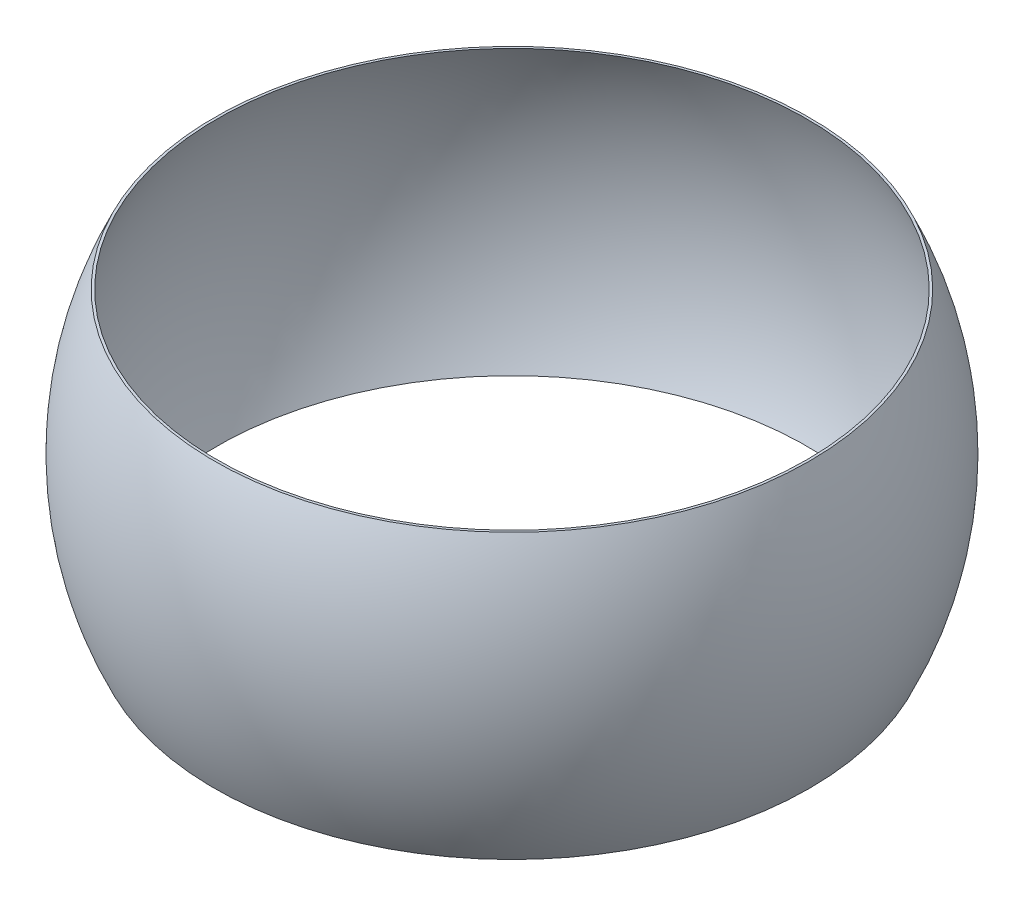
ISO-10303-21;
HEADER;
FILE_DESCRIPTION(('STEP AP214'),'2;1');
FILE_NAME('part.step','',(''),(''),'','','');
FILE_SCHEMA(('AUTOMOTIVE_DESIGN { 1 0 10303 214 1 1 1 1 }'));
ENDSEC;
DATA;
#1=APPLICATION_CONTEXT('core data for automotive mechanical design processes');
#2=APPLICATION_PROTOCOL_DEFINITION('international standard','automotive_design',2000,#1);
#3=PRODUCT_CONTEXT('',#1,'mechanical');
#4=PRODUCT('Part','Part','',(#3));
#5=PRODUCT_RELATED_PRODUCT_CATEGORY('part','',(#4));
#6=PRODUCT_DEFINITION_FORMATION('','',#4);
#7=PRODUCT_DEFINITION_CONTEXT('part definition',#1,'design');
#8=PRODUCT_DEFINITION('design','',#6,#7);
#9=PRODUCT_DEFINITION_SHAPE('','',#8);
#10=(LENGTH_UNIT() NAMED_UNIT(*) SI_UNIT(.MILLI.,.METRE.));
#11=(NAMED_UNIT(*) PLANE_ANGLE_UNIT() SI_UNIT($,.RADIAN.));
#12=(NAMED_UNIT(*) SI_UNIT($,.STERADIAN.) SOLID_ANGLE_UNIT());
#13=UNCERTAINTY_MEASURE_WITH_UNIT(LENGTH_MEASURE(1.E-05),#10,'distance_accuracy_value','');
#14=(GEOMETRIC_REPRESENTATION_CONTEXT(3) GLOBAL_UNCERTAINTY_ASSIGNED_CONTEXT((#13)) GLOBAL_UNIT_ASSIGNED_CONTEXT((#10,
#11,#12)) REPRESENTATION_CONTEXT('',''));
#15=CARTESIAN_POINT('',(0.,0.,0.));
#16=DIRECTION('',(0.,0.,1.));
#17=DIRECTION('',(1.,0.,0.));
#18=AXIS2_PLACEMENT_3D('',#15,#16,#17);
#19=CARTESIAN_POINT('',(0.,0.,0.));
#20=DIRECTION('',(0.,1.,0.));
#21=DIRECTION('',(1.,0.,0.));
#22=AXIS2_PLACEMENT_3D('',#19,#20,#21);
#23=SPHERICAL_SURFACE('',#22,7.4803);
#24=CARTESIAN_POINT('',(0.,-3.23850000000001,0.));
#25=DIRECTION('',(0.,1.,0.));
#26=DIRECTION('',(0.,0.,1.));
#27=AXIS2_PLACEMENT_3D('',#24,#25,#26);
#28=CIRCLE('',#27,6.74292264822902);
#29=CARTESIAN_POINT('',(6.74292264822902,-3.23850000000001,0.));
#30=VERTEX_POINT('',#29);
#31=EDGE_CURVE('E10',#30,#30,#28,.T.);
#32=CARTESIAN_POINT('',(0.,3.23849999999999,0.));
#33=DIRECTION('',(0.,1.,0.));
#34=DIRECTION('',(0.,0.,1.));
#35=AXIS2_PLACEMENT_3D('',#32,#33,#34);
#36=CIRCLE('',#35,6.74292264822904);
#37=CARTESIAN_POINT('',(6.74292264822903,3.23849999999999,0.));
#38=VERTEX_POINT('',#37);
#39=EDGE_CURVE('E48',#38,#38,#36,.T.);
#40=CARTESIAN_POINT('',(6.74292264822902,-3.23850000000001,0.));
#41=CARTESIAN_POINT('',(6.77313193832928,-3.17560148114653,0.));
#42=CARTESIAN_POINT('',(6.80246064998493,-3.11228005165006,0.));
#43=CARTESIAN_POINT('',(6.85933505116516,-2.98484144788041,0.));
#44=CARTESIAN_POINT('',(6.88688074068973,-2.92072427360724,0.));
#45=CARTESIAN_POINT('',(6.94016723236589,-2.79174425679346,0.));
#46=CARTESIAN_POINT('',(6.96590803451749,-2.72688141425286,0.));
#47=CARTESIAN_POINT('',(7.01556467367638,-2.59646088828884,0.));
#48=CARTESIAN_POINT('',(7.03948051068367,-2.53090320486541,0.));
#49=CARTESIAN_POINT('',(7.08546847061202,-2.39914432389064,0.));
#50=CARTESIAN_POINT('',(7.10754059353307,-2.33294312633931,0.));
#51=CARTESIAN_POINT('',(7.14982384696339,-2.19994905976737,0.));
#52=CARTESIAN_POINT('',(7.17003497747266,-2.13315619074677,0.));
#53=CARTESIAN_POINT('',(7.20858041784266,-1.99903108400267,0.));
#54=CARTESIAN_POINT('',(7.22691472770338,-1.93169884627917,0.));
#55=CARTESIAN_POINT('',(7.26169217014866,-1.79654772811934,0.));
#56=CARTESIAN_POINT('',(7.2781353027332,-1.72872884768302,0.));
#57=CARTESIAN_POINT('',(7.30911751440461,-1.59265755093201,0.));
#58=CARTESIAN_POINT('',(7.32365659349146,-1.52440513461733,0.));
#59=CARTESIAN_POINT('',(7.35081931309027,-1.38752021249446,0.));
#60=CARTESIAN_POINT('',(7.36344295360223,-1.31888770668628,0.));
#61=CARTESIAN_POINT('',(7.38676491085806,-1.18129634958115,0.));
#62=CARTESIAN_POINT('',(7.39746322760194,-1.11233749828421,0.));
#63=CARTESIAN_POINT('',(7.41692615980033,-0.974147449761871,0.));
#64=CARTESIAN_POINT('',(7.42569077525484,-0.904916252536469,0.));
#65=CARTESIAN_POINT('',(7.44127944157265,-0.766235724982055,0.));
#66=CARTESIAN_POINT('',(7.44810349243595,-0.696786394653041,0.));
#67=CARTESIAN_POINT('',(7.45980568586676,-0.557723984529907,0.));
#68=CARTESIAN_POINT('',(7.46468382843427,-0.488110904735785,0.));
#69=CARTESIAN_POINT('',(7.47249038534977,-0.348775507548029,0.));
#70=CARTESIAN_POINT('',(7.47541879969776,-0.279053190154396,0.));
#71=CARTESIAN_POINT('',(7.47932360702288,-0.139553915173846,0.));
#72=CARTESIAN_POINT('',(7.4803,-0.0697769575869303,0.));
#73=CARTESIAN_POINT('',(7.4803,0.0697769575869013,0.));
#74=CARTESIAN_POINT('',(7.47932360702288,0.139553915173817,0.));
#75=CARTESIAN_POINT('',(7.47541879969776,0.279053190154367,0.));
#76=CARTESIAN_POINT('',(7.47249038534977,0.348775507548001,0.));
#77=CARTESIAN_POINT('',(7.46468382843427,0.488110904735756,0.));
#78=CARTESIAN_POINT('',(7.45980568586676,0.557723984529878,0.));
#79=CARTESIAN_POINT('',(7.44810349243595,0.696786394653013,0.));
#80=CARTESIAN_POINT('',(7.44127944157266,0.766235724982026,0.));
#81=CARTESIAN_POINT('',(7.42569077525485,0.90491625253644,0.));
#82=CARTESIAN_POINT('',(7.41692615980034,0.974147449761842,0.));
#83=CARTESIAN_POINT('',(7.39746322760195,1.11233749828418,0.));
#84=CARTESIAN_POINT('',(7.38676491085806,1.18129634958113,0.));
#85=CARTESIAN_POINT('',(7.36344295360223,1.31888770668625,0.));
#86=CARTESIAN_POINT('',(7.35081931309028,1.38752021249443,0.));
#87=CARTESIAN_POINT('',(7.32365659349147,1.5244051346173,0.));
#88=CARTESIAN_POINT('',(7.30911751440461,1.59265755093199,0.));
#89=CARTESIAN_POINT('',(7.27813530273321,1.72872884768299,0.));
#90=CARTESIAN_POINT('',(7.26169217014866,1.79654772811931,0.));
#91=CARTESIAN_POINT('',(7.22691472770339,1.93169884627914,0.));
#92=CARTESIAN_POINT('',(7.20858041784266,1.99903108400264,0.));
#93=CARTESIAN_POINT('',(7.17003497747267,2.13315619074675,0.));
#94=CARTESIAN_POINT('',(7.1498238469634,2.19994905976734,0.));
#95=CARTESIAN_POINT('',(7.10754059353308,2.33294312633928,0.));
#96=CARTESIAN_POINT('',(7.08546847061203,2.39914432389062,0.));
#97=CARTESIAN_POINT('',(7.03948051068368,2.53090320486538,0.));
#98=CARTESIAN_POINT('',(7.01556467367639,2.59646088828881,0.));
#99=CARTESIAN_POINT('',(6.9659080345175,2.72688141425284,0.));
#100=CARTESIAN_POINT('',(6.9401672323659,2.79174425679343,0.));
#101=CARTESIAN_POINT('',(6.88688074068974,2.92072427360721,0.));
#102=CARTESIAN_POINT('',(6.85933505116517,2.98484144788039,0.));
#103=CARTESIAN_POINT('',(6.80246064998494,3.11228005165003,0.));
#104=CARTESIAN_POINT('',(6.77313193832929,3.17560148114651,0.));
#105=CARTESIAN_POINT('',(6.74292264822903,3.23849999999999,0.));
#106=B_SPLINE_CURVE_WITH_KNOTS('',3,(#40,#41,#42,#43,#44,#45,#46,#47,#48,#49,#50,#51,#52,#53,
#54,#55,#56,#57,#58,#59,#60,#61,#62,#63,#64,#65,#66,#67,#68,#69,#70,#71,#72,#73,#74,#75,#76,#77,
#78,#79,#80,#81,#82,#83,#84,#85,#86,#87,#88,#89,#90,#91,#92,#93,#94,#95,#96,#97,#98,#99,#100,
#101,#102,#103,#104,#105),.UNSPECIFIED.,.F.,.F.,(4,2,2,2,2,2,2,2,2,2,2,2,2,2,2,2,2,2,2,2,2,2,2,
2,2,2,2,2,2,2,2,2,4),(0.,0.20932404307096,0.41864808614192,0.627972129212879,0.837296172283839,
1.0466202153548,1.25594425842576,1.46526830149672,1.67459234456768,1.88391638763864,
2.0932404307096,2.30256447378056,2.51188851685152,2.72121255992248,2.93053660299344,
3.1398606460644,3.34918468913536,3.55850873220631,3.76783277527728,3.97715681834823,
4.1864808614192,4.39580490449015,4.60512894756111,4.81445299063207,5.02377703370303,
5.23310107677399,5.44242511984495,5.65174916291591,5.86107320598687,6.07039724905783,
6.27972129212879,6.48904533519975,6.69836937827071),.UNSPECIFIED.);
#107=EDGE_CURVE('BSEAM34',#30,#38,#106,.T.);
#108=ORIENTED_EDGE('',*,*,#31,.F.);
#109=ORIENTED_EDGE('',*,*,#39,.T.);
#110=ORIENTED_EDGE('',*,*,#107,.T.);
#111=ORIENTED_EDGE('',*,*,#107,.F.);
#112=EDGE_LOOP('',(#108,#110,#109,#111));
#113=FACE_BOUND('',#112,.T.);
#114=ADVANCED_FACE('F34',(#113),#23,.F.);
#115=CARTESIAN_POINT('',(6.74292264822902,-3.23850000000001,0.));
#116=DIRECTION('',(0.,1.,0.));
#117=DIRECTION('',(0.,0.,1.));
#118=AXIS2_PLACEMENT_3D('',#115,#116,#117);
#119=PLANE('',#118);
#120=CARTESIAN_POINT('',(0.,-3.23850000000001,0.));
#121=DIRECTION('',(0.,1.,0.));
#122=DIRECTION('',(0.,0.,1.));
#123=AXIS2_PLACEMENT_3D('',#120,#121,#122);
#124=CIRCLE('',#123,6.79923414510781);
#125=CARTESIAN_POINT('',(6.79923414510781,-3.23850000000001,0.));
#126=VERTEX_POINT('',#125);
#127=EDGE_CURVE('E40',#126,#126,#124,.T.);
#128=ORIENTED_EDGE('',*,*,#127,.F.);
#129=EDGE_LOOP('',(#128));
#130=FACE_BOUND('',#129,.T.);
#131=ORIENTED_EDGE('',*,*,#31,.T.);
#132=EDGE_LOOP('',(#131));
#133=FACE_BOUND('',#132,.T.);
#134=ADVANCED_FACE('F63',(#130,#133),#119,.F.);
#135=CARTESIAN_POINT('',(0.,0.,0.));
#136=DIRECTION('',(0.,1.,0.));
#137=DIRECTION('',(1.,0.,0.));
#138=AXIS2_PLACEMENT_3D('',#135,#136,#137);
#139=SPHERICAL_SURFACE('',#138,7.5311);
#140=CARTESIAN_POINT('',(0.,3.23849999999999,0.));
#141=DIRECTION('',(0.,1.,0.));
#142=DIRECTION('',(0.,0.,1.));
#143=AXIS2_PLACEMENT_3D('',#140,#141,#142);
#144=CIRCLE('',#143,6.79923414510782);
#145=CARTESIAN_POINT('',(6.79923414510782,3.23849999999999,0.));
#146=VERTEX_POINT('',#145);
#147=EDGE_CURVE('E44',#146,#146,#144,.T.);
#148=CARTESIAN_POINT('',(6.79923414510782,3.23849999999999,0.));
#149=CARTESIAN_POINT('',(6.82922502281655,3.175534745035,0.));
#150=CARTESIAN_POINT('',(6.85834076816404,3.11215267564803,0.));
#151=CARTESIAN_POINT('',(6.9148006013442,2.98460430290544,0.));
#152=CARTESIAN_POINT('',(6.94214468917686,2.92043799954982,0.));
#153=CARTESIAN_POINT('',(6.995039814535,2.79137055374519,0.));
#154=CARTESIAN_POINT('',(7.02059085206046,2.72646941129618,0.));
#155=CARTESIAN_POINT('',(7.06988023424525,2.59598241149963,0.));
#156=CARTESIAN_POINT('',(7.09361857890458,2.53039655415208,0.));
#157=CARTESIAN_POINT('',(7.13926423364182,2.39859073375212,0.));
#158=CARTESIAN_POINT('',(7.16117154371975,2.33237077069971,0.));
#159=CARTESIAN_POINT('',(7.20313822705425,2.19934784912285,0.));
#160=CARTESIAN_POINT('',(7.22319760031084,2.1325448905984,0.));
#161=CARTESIAN_POINT('',(7.26145292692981,1.99840753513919,0.));
#162=CARTESIAN_POINT('',(7.2796488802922,1.93107313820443,0.));
#163=CARTESIAN_POINT('',(7.31416332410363,1.79592487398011,0.));
#164=CARTESIAN_POINT('',(7.33048181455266,1.72811100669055,0.));
#165=CARTESIAN_POINT('',(7.36122873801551,1.59205613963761,0.));
#166=CARTESIAN_POINT('',(7.37565717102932,1.52381513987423,0.));
#167=CARTESIAN_POINT('',(7.40261284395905,1.38695867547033,0.));
#168=CARTESIAN_POINT('',(7.41514008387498,1.31834321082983,0.));
#169=CARTESIAN_POINT('',(7.43828370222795,1.18079077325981,0.));
#170=CARTESIAN_POINT('',(7.448900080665,1.11185380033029,0.));
#171=CARTESIAN_POINT('',(7.46821378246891,0.973711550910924,0.));
#172=CARTESIAN_POINT('',(7.47691110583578,0.904506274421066,0.));
#173=CARTESIAN_POINT('',(7.49237998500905,0.765880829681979,0.));
#174=CARTESIAN_POINT('',(7.49915154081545,0.696460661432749,0.));
#175=CARTESIAN_POINT('',(7.51076365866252,0.557459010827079,0.));
#176=CARTESIAN_POINT('',(7.51560422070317,0.487877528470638,0.));
#177=CARTESIAN_POINT('',(7.52335061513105,0.348606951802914,0.));
#178=CARTESIAN_POINT('',(7.52625644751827,0.278917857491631,0.));
#179=CARTESIAN_POINT('',(7.53013113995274,0.139485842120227,0.));
#180=CARTESIAN_POINT('',(7.5311,0.0697429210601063,0.));
#181=CARTESIAN_POINT('',(7.5311,-0.0697429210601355,0.));
#182=CARTESIAN_POINT('',(7.53013113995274,-0.139485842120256,0.));
#183=CARTESIAN_POINT('',(7.52625644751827,-0.278917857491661,0.));
#184=CARTESIAN_POINT('',(7.52335061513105,-0.348606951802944,0.));
#185=CARTESIAN_POINT('',(7.51560422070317,-0.487877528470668,0.));
#186=CARTESIAN_POINT('',(7.51076365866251,-0.557459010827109,0.));
#187=CARTESIAN_POINT('',(7.49915154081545,-0.696460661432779,0.));
#188=CARTESIAN_POINT('',(7.49237998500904,-0.765880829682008,0.));
#189=CARTESIAN_POINT('',(7.47691110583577,-0.904506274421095,0.));
#190=CARTESIAN_POINT('',(7.46821378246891,-0.973711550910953,0.));
#191=CARTESIAN_POINT('',(7.448900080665,-1.11185380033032,0.));
#192=CARTESIAN_POINT('',(7.43828370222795,-1.18079077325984,0.));
#193=CARTESIAN_POINT('',(7.41514008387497,-1.31834321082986,0.));
#194=CARTESIAN_POINT('',(7.40261284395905,-1.38695867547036,0.));
#195=CARTESIAN_POINT('',(7.37565717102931,-1.52381513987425,0.));
#196=CARTESIAN_POINT('',(7.36122873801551,-1.59205613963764,0.));
#197=CARTESIAN_POINT('',(7.33048181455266,-1.72811100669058,0.));
#198=CARTESIAN_POINT('',(7.31416332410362,-1.79592487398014,0.));
#199=CARTESIAN_POINT('',(7.27964888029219,-1.93107313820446,0.));
#200=CARTESIAN_POINT('',(7.2614529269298,-1.99840753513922,0.));
#201=CARTESIAN_POINT('',(7.22319760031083,-2.13254489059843,0.));
#202=CARTESIAN_POINT('',(7.20313822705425,-2.19934784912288,0.));
#203=CARTESIAN_POINT('',(7.16117154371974,-2.33237077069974,0.));
#204=CARTESIAN_POINT('',(7.13926423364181,-2.39859073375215,0.));
#205=CARTESIAN_POINT('',(7.09361857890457,-2.53039655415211,0.));
#206=CARTESIAN_POINT('',(7.06988023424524,-2.59598241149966,0.));
#207=CARTESIAN_POINT('',(7.02059085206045,-2.72646941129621,0.));
#208=CARTESIAN_POINT('',(6.99503981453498,-2.79137055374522,0.));
#209=CARTESIAN_POINT('',(6.94214468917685,-2.92043799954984,0.));
#210=CARTESIAN_POINT('',(6.91480060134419,-2.98460430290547,0.));
#211=CARTESIAN_POINT('',(6.85834076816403,-3.11215267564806,0.));
#212=CARTESIAN_POINT('',(6.82922502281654,-3.17553474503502,0.));
#213=CARTESIAN_POINT('',(6.79923414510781,-3.23850000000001,0.));
#214=B_SPLINE_CURVE_WITH_KNOTS('',3,(#148,#149,#150,#151,#152,#153,#154,#155,#156,#157,#158,
#159,#160,#161,#162,#163,#164,#165,#166,#167,#168,#169,#170,#171,#172,#173,#174,#175,#176,#177,
#178,#179,#180,#181,#182,#183,#184,#185,#186,#187,#188,#189,#190,#191,#192,#193,#194,#195,#196,
#197,#198,#199,#200,#201,#202,#203,#204,#205,#206,#207,#208,#209,#210,#211,#212,#213),
.UNSPECIFIED.,.F.,.F.,(4,2,2,2,2,2,2,2,2,2,2,2,2,2,2,2,2,2,2,2,2,2,2,2,2,2,2,2,2,2,2,2,4),(0.,
0.209222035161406,0.418444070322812,0.627666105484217,0.836888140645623,1.04611017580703,
1.25533221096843,1.46455424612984,1.67377628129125,1.88299831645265,2.09222035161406,
2.30144238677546,2.51066442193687,2.71988645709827,2.92910849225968,3.13833052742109,
3.34755256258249,3.5567745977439,3.7659966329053,3.97521866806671,4.18444070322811,
4.39366273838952,4.60288477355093,4.81210680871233,5.02132884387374,5.23055087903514,
5.43977291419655,5.64899494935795,5.85821698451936,6.06743901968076,6.27666105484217,
6.48588309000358,6.69510512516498),.UNSPECIFIED.);
#215=EDGE_CURVE('BSEAM58',#146,#126,#214,.T.);
#216=ORIENTED_EDGE('',*,*,#147,.F.);
#217=ORIENTED_EDGE('',*,*,#127,.T.);
#218=ORIENTED_EDGE('',*,*,#215,.T.);
#219=ORIENTED_EDGE('',*,*,#215,.F.);
#220=EDGE_LOOP('',(#216,#218,#217,#219));
#221=FACE_BOUND('',#220,.T.);
#222=ADVANCED_FACE('F58',(#221),#139,.T.);
#223=CARTESIAN_POINT('',(6.74292264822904,3.23849999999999,0.));
#224=DIRECTION('',(0.,-1.,0.));
#225=DIRECTION('',(0.,0.,-1.));
#226=AXIS2_PLACEMENT_3D('',#223,#224,#225);
#227=PLANE('',#226);
#228=ORIENTED_EDGE('',*,*,#39,.F.);
#229=EDGE_LOOP('',(#228));
#230=FACE_BOUND('',#229,.T.);
#231=ORIENTED_EDGE('',*,*,#147,.T.);
#232=EDGE_LOOP('',(#231));
#233=FACE_BOUND('',#232,.T.);
#234=ADVANCED_FACE('F55',(#230,#233),#227,.F.);
#235=CLOSED_SHELL('',(#114,#134,#222,#234));
#236=MANIFOLD_SOLID_BREP('B2',#235);
#237=ADVANCED_BREP_SHAPE_REPRESENTATION('',(#18,#236),#14);
#238=SHAPE_DEFINITION_REPRESENTATION(#9,#237);
ENDSEC;
END-ISO-10303-21;
